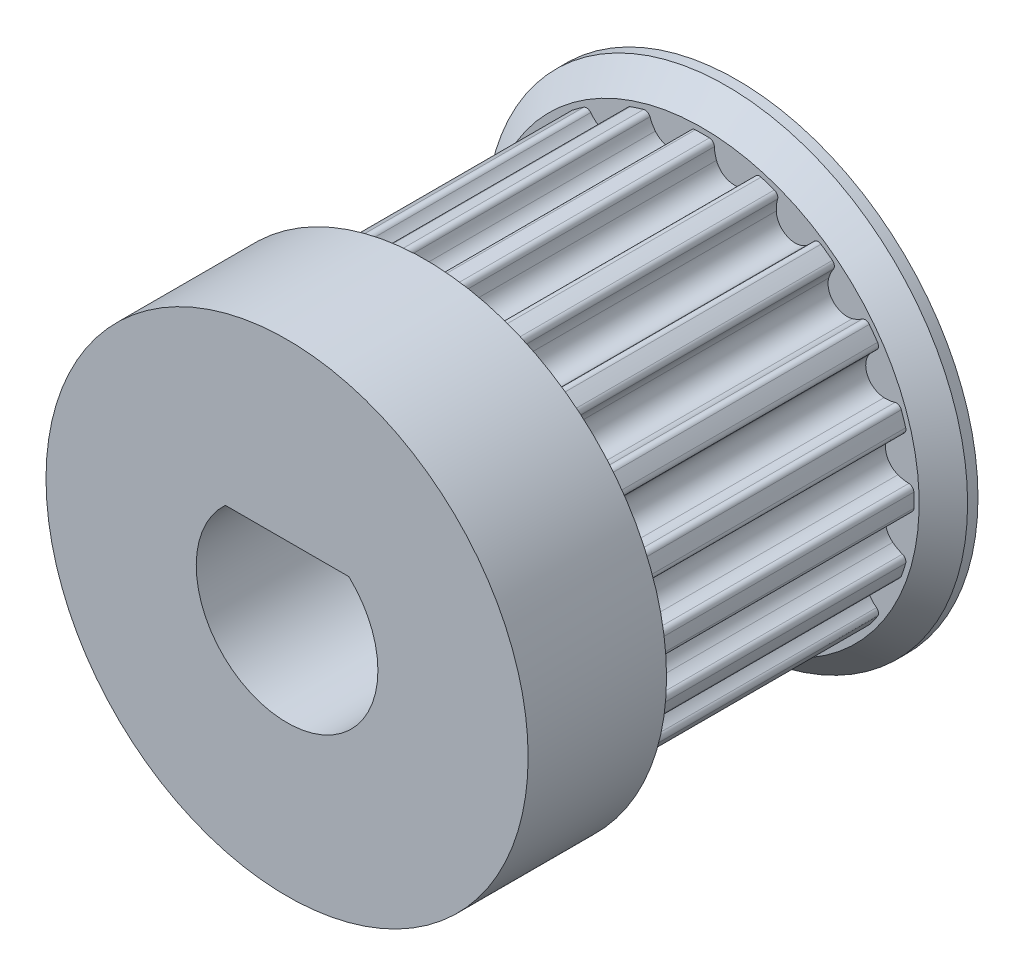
from build123d import *

# Parameters (mm, degrees)
SKETCH1_R           = 6.366197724
BOSS_EXTRUDE1_DEPTH = 4
CUT_EXTRUDE1_DEPTH  = 8
CIRPATTERN1_COUNT   = 20
SKETCH4_R           = 6.966197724
BOSS_EXTRUDE2_DEPTH = 1
CHAMFER1_SIZE       = 0.7
CUT_EXTRUDE2_DEPTH  = 15.037657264
BOSS_EXTRUDE3_START = 3
SKETCH6_R           = 6.966197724
BOSS_EXTRUDE3_DEPTH = 3
CUT_EXTRUDE3_START  = -3
SKETCH8_R           = 2.625
CUT_EXTRUDE3_DEPTH  = 3


with BuildPart() as part:
    # Sketch1 → Boss-Extrude1 (new, symmetric)
    with BuildSketch(Plane.XY):
        Circle(SKETCH1_R)
    extrude(amount=BOSS_EXTRUDE1_DEPTH, both=True)

    # Sketch3 → Cut-Extrude1 (cut)
    with BuildSketch(Plane.XY.offset(4)):
        with BuildLine():
            Line((0, 6.366197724), (0, 6.116197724))
            ThreePointArc((0, 6.116197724), (0.101740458, 6.11535146), (0.203452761, 6.112812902))
            ThreePointArc((0.203452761, 6.112812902), (0.304651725, 6.068839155), (0.348391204, 5.967538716))
            ThreePointArc((0.348391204, 5.967538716), (0.366184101, 5.808200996), (0.409212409, 5.653754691))
            ThreePointArc((0.409212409, 5.653754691), (0.83945827, 5.300130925), (1.357922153, 5.503493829))
            ThreePointArc((1.357922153, 5.503493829), (1.446571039, 5.637084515), (1.512731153, 5.783125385))
            ThreePointArc((1.512731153, 5.783125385), (1.585633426, 5.865951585), (1.695467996, 5.876500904))
            ThreePointArc((1.695467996, 5.876500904), (1.792986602, 5.847484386), (1.890009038, 5.8168497))
            Line((1.890009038, 5.8168497), (1.967263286, 6.054613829))
            ThreePointArc((1.967263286, 6.054613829), (0.995892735, 6.287819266), (0, 6.366197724))
        make_face()
    cut_extrude1 = extrude(amount=-CUT_EXTRUDE1_DEPTH, mode=Mode.SUBTRACT)

    # CirPattern1: Cut-Extrude1 ×20 about axis
    cirpattern1_axis = Axis((0, 0, 0), (0, 0, 1))
    for i in range(1, CIRPATTERN1_COUNT):
        add(cut_extrude1.rotate(cirpattern1_axis, i * 360 / CIRPATTERN1_COUNT), mode=Mode.SUBTRACT)

    # Sketch4 → Boss-Extrude2 (add)
    with BuildSketch(Plane.XY.offset(4)):
        Circle(SKETCH4_R)
    boss_extrude2 = extrude(amount=BOSS_EXTRUDE2_DEPTH)

    # Mirror1: Boss-Extrude2 across plane
    add(boss_extrude2.mirror(Plane.XY))

    # Chamfer1
    chamfer1_edges = [part.edges().sort_by_distance(p)[0] for p in [
        (-6.966197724, 0, -4),
    ]]
    chamfer(chamfer1_edges, length=CHAMFER1_SIZE)

    # Sketch5 → Cut-Extrude2 (cut, through all)
    with BuildSketch(Plane.XY.offset(5)):
        with BuildLine():
            Line((1.78465683, 1.925), (-1.78465683, 1.925))
            ThreePointArc((-1.78465683, 1.925), (-1.05021446, -2.405758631), (2.625, 0))
            ThreePointArc((2.625, 0), (2.405758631, 1.05021446), (1.78465683, 1.925))
        make_face()
    extrude(amount=-CUT_EXTRUDE2_DEPTH, mode=Mode.SUBTRACT)

    # Sketch6 → Boss-Extrude3 (add)
    with BuildSketch(Plane.XY.offset(5).offset(BOSS_EXTRUDE3_START)):
        Circle(SKETCH6_R)
        with BuildLine():
            Line((-1.78465683, 1.925), (1.78465683, 1.925))
            ThreePointArc((1.78465683, 1.925), (0, -2.625), (-1.78465683, 1.925))
        make_face(mode=Mode.SUBTRACT)
    extrude(amount=-BOSS_EXTRUDE3_DEPTH)

    # Sketch8 → Cut-Extrude3 (cut)
    with BuildSketch(Plane(origin=(0, 0, -5), x_dir=(-1, 0, 0), z_dir=(0, 0, -1)).offset(CUT_EXTRUDE3_START)):
        with Locations(Location((0, 0, 0), (0, 0, 180))):
            Circle(SKETCH8_R)
    extrude(amount=CUT_EXTRUDE3_DEPTH, mode=Mode.SUBTRACT)


solid = part.part
